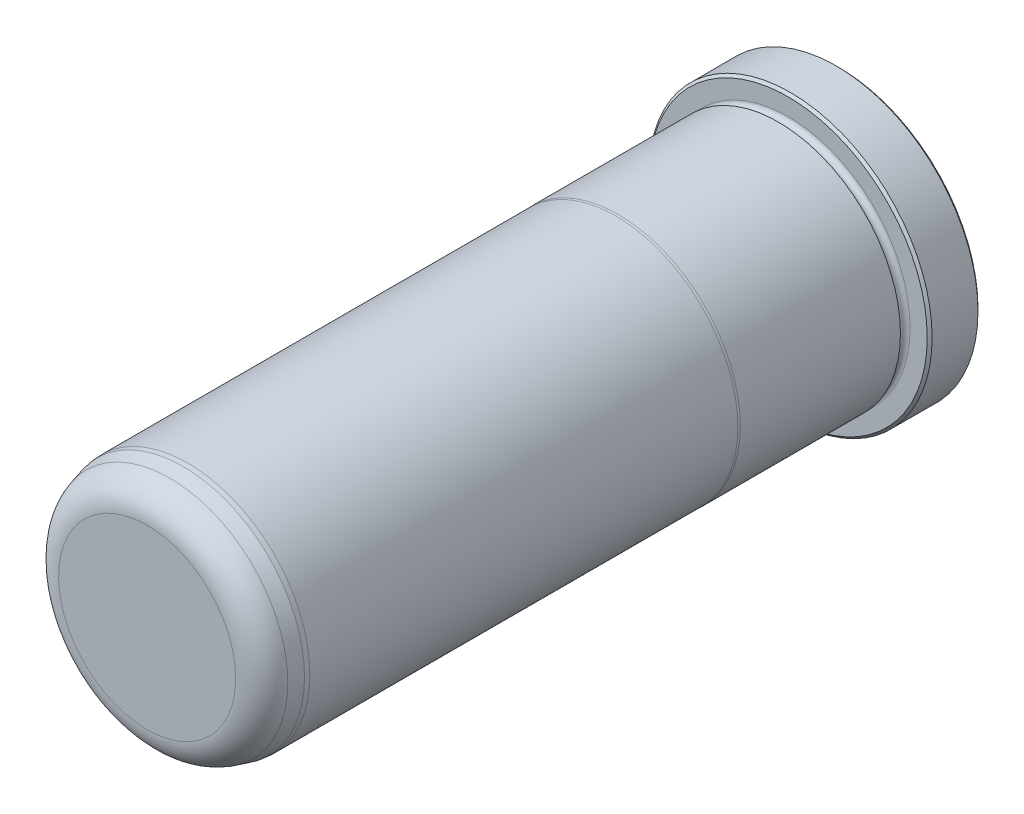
ISO-10303-21;
HEADER;
FILE_DESCRIPTION(('STEP AP214'),'2;1');
FILE_NAME('part.step','',(''),(''),'','','');
FILE_SCHEMA(('AUTOMOTIVE_DESIGN { 1 0 10303 214 1 1 1 1 }'));
ENDSEC;
DATA;
#1=APPLICATION_CONTEXT('core data for automotive mechanical design processes');
#2=APPLICATION_PROTOCOL_DEFINITION('international standard','automotive_design',2000,#1);
#3=PRODUCT_CONTEXT('',#1,'mechanical');
#4=PRODUCT('Part','Part','',(#3));
#5=PRODUCT_RELATED_PRODUCT_CATEGORY('part','',(#4));
#6=PRODUCT_DEFINITION_FORMATION('','',#4);
#7=PRODUCT_DEFINITION_CONTEXT('part definition',#1,'design');
#8=PRODUCT_DEFINITION('design','',#6,#7);
#9=PRODUCT_DEFINITION_SHAPE('','',#8);
#10=(LENGTH_UNIT() NAMED_UNIT(*) SI_UNIT(.MILLI.,.METRE.));
#11=(NAMED_UNIT(*) PLANE_ANGLE_UNIT() SI_UNIT($,.RADIAN.));
#12=(NAMED_UNIT(*) SI_UNIT($,.STERADIAN.) SOLID_ANGLE_UNIT());
#13=UNCERTAINTY_MEASURE_WITH_UNIT(LENGTH_MEASURE(1.E-05),#10,'distance_accuracy_value','');
#14=(GEOMETRIC_REPRESENTATION_CONTEXT(3) GLOBAL_UNCERTAINTY_ASSIGNED_CONTEXT((#13)) GLOBAL_UNIT_ASSIGNED_CONTEXT((#10,
#11,#12)) REPRESENTATION_CONTEXT('',''));
#15=CARTESIAN_POINT('',(0.,0.,0.));
#16=DIRECTION('',(0.,0.,1.));
#17=DIRECTION('',(1.,0.,0.));
#18=AXIS2_PLACEMENT_3D('',#15,#16,#17);
#19=CARTESIAN_POINT('',(0.,0.,0.));
#20=DIRECTION('',(0.,0.,1.));
#21=DIRECTION('',(1.,0.,0.));
#22=AXIS2_PLACEMENT_3D('',#19,#20,#21);
#23=PLANE('',#22);
#24=CARTESIAN_POINT('',(0.,0.,0.));
#25=DIRECTION('',(0.,0.,1.));
#26=DIRECTION('',(1.,0.,0.));
#27=AXIS2_PLACEMENT_3D('',#24,#25,#26);
#28=CIRCLE('',#27,21.717);
#29=CARTESIAN_POINT('',(21.717,0.,0.));
#30=VERTEX_POINT('',#29);
#31=EDGE_CURVE('E37',#30,#30,#28,.F.);
#32=ORIENTED_EDGE('',*,*,#31,.T.);
#33=EDGE_LOOP('',(#32));
#34=FACE_BOUND('',#33,.T.);
#35=ADVANCED_FACE('F30',(#34),#23,.F.);
#36=CARTESIAN_POINT('',(0.,0.,0.));
#37=DIRECTION('',(0.,0.,1.));
#38=DIRECTION('',(1.,0.,0.));
#39=AXIS2_PLACEMENT_3D('',#36,#37,#38);
#40=CYLINDRICAL_SURFACE('',#39,22.098);
#41=CARTESIAN_POINT('',(0.,0.,0.381000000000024));
#42=DIRECTION('',(0.,0.,1.));
#43=DIRECTION('',(1.,0.,0.));
#44=AXIS2_PLACEMENT_3D('',#41,#42,#43);
#45=CIRCLE('',#44,22.098);
#46=CARTESIAN_POINT('',(22.098,0.,0.381000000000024));
#47=VERTEX_POINT('',#46);
#48=EDGE_CURVE('E41',#47,#47,#45,.T.);
#49=ORIENTED_EDGE('',*,*,#48,.T.);
#50=EDGE_LOOP('',(#49));
#51=FACE_BOUND('',#50,.T.);
#52=CARTESIAN_POINT('',(0.,0.,7.5438));
#53=DIRECTION('',(0.,0.,-1.));
#54=DIRECTION('',(-1.,0.,0.));
#55=AXIS2_PLACEMENT_3D('',#52,#53,#54);
#56=CIRCLE('',#55,22.098);
#57=CARTESIAN_POINT('',(-22.098,0.,7.5438));
#58=VERTEX_POINT('',#57);
#59=EDGE_CURVE('E45',#58,#58,#56,.T.);
#60=ORIENTED_EDGE('',*,*,#59,.T.);
#61=EDGE_LOOP('',(#60));
#62=FACE_BOUND('',#61,.T.);
#63=ADVANCED_FACE('F118',(#51,#62),#40,.T.);
#64=CARTESIAN_POINT('',(0.,22.098,7.9248));
#65=DIRECTION('',(0.,0.,-1.));
#66=DIRECTION('',(-1.,0.,0.));
#67=AXIS2_PLACEMENT_3D('',#64,#65,#66);
#68=PLANE('',#67);
#69=CARTESIAN_POINT('',(0.,0.,7.9248));
#70=DIRECTION('',(0.,0.,-1.));
#71=DIRECTION('',(-1.,0.,0.));
#72=AXIS2_PLACEMENT_3D('',#69,#70,#71);
#73=CIRCLE('',#72,21.717);
#74=CARTESIAN_POINT('',(-21.717,0.,7.9248));
#75=VERTEX_POINT('',#74);
#76=EDGE_CURVE('E10',#75,#75,#73,.F.);
#77=ORIENTED_EDGE('',*,*,#76,.T.);
#78=EDGE_LOOP('',(#77));
#79=FACE_BOUND('',#78,.T.);
#80=CARTESIAN_POINT('',(0.,0.,7.9248));
#81=DIRECTION('',(0.,0.,1.));
#82=DIRECTION('',(1.,0.,0.));
#83=AXIS2_PLACEMENT_3D('',#80,#81,#82);
#84=CIRCLE('',#83,19.0373);
#85=CARTESIAN_POINT('',(19.0373,0.,7.9248));
#86=VERTEX_POINT('',#85);
#87=EDGE_CURVE('E56',#86,#86,#84,.T.);
#88=ORIENTED_EDGE('',*,*,#87,.F.);
#89=EDGE_LOOP('',(#88));
#90=FACE_BOUND('',#89,.T.);
#91=ADVANCED_FACE('F113',(#79,#90),#68,.F.);
#92=CARTESIAN_POINT('',(0.,0.,8.6868));
#93=DIRECTION('',(0.,0.,1.));
#94=DIRECTION('',(1.,0.,0.));
#95=AXIS2_PLACEMENT_3D('',#92,#93,#94);
#96=TOROIDAL_SURFACE('',#95,19.0373,0.762);
#97=CARTESIAN_POINT('',(0.,0.,9.4488));
#98=DIRECTION('',(0.,0.,1.));
#99=DIRECTION('',(1.,0.,0.));
#100=AXIS2_PLACEMENT_3D('',#97,#98,#99);
#101=CIRCLE('',#100,19.0373);
#102=CARTESIAN_POINT('',(19.0373,0.,9.4488));
#103=VERTEX_POINT('',#102);
#104=EDGE_CURVE('E59',#103,#103,#101,.T.);
#105=ORIENTED_EDGE('',*,*,#104,.F.);
#106=EDGE_LOOP('',(#105));
#107=FACE_BOUND('',#106,.T.);
#108=ORIENTED_EDGE('',*,*,#87,.T.);
#109=EDGE_LOOP('',(#108));
#110=FACE_BOUND('',#109,.T.);
#111=ADVANCED_FACE('F107',(#107,#110),#96,.F.);
#112=CARTESIAN_POINT('',(0.,19.0373,9.4488));
#113=DIRECTION('',(0.,0.,1.));
#114=DIRECTION('',(1.,0.,0.));
#115=AXIS2_PLACEMENT_3D('',#112,#113,#114);
#116=PLANE('',#115);
#117=CARTESIAN_POINT('',(0.,0.,9.4488));
#118=DIRECTION('',(0.,0.,1.));
#119=DIRECTION('',(1.,0.,0.));
#120=AXIS2_PLACEMENT_3D('',#117,#118,#119);
#121=CIRCLE('',#120,19.0627);
#122=CARTESIAN_POINT('',(19.0627,0.,9.4488));
#123=VERTEX_POINT('',#122);
#124=EDGE_CURVE('E62',#123,#123,#121,.T.);
#125=ORIENTED_EDGE('',*,*,#124,.F.);
#126=EDGE_LOOP('',(#125));
#127=FACE_BOUND('',#126,.T.);
#128=ORIENTED_EDGE('',*,*,#104,.T.);
#129=EDGE_LOOP('',(#128));
#130=FACE_BOUND('',#129,.T.);
#131=ADVANCED_FACE('F101',(#127,#130),#116,.F.);
#132=CARTESIAN_POINT('',(0.,0.,0.));
#133=DIRECTION('',(0.,0.,1.));
#134=DIRECTION('',(1.,0.,0.));
#135=AXIS2_PLACEMENT_3D('',#132,#133,#134);
#136=CYLINDRICAL_SURFACE('',#135,19.0627);
#137=CARTESIAN_POINT('',(0.,0.,34.4347630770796));
#138=DIRECTION('',(0.,0.,1.));
#139=DIRECTION('',(1.,0.,0.));
#140=AXIS2_PLACEMENT_3D('',#137,#138,#139);
#141=CIRCLE('',#140,19.0627);
#142=CARTESIAN_POINT('',(19.0627,0.,34.4347630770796));
#143=VERTEX_POINT('',#142);
#144=EDGE_CURVE('E65',#143,#143,#141,.T.);
#145=ORIENTED_EDGE('',*,*,#144,.F.);
#146=EDGE_LOOP('',(#145));
#147=FACE_BOUND('',#146,.T.);
#148=ORIENTED_EDGE('',*,*,#124,.T.);
#149=EDGE_LOOP('',(#148));
#150=FACE_BOUND('',#149,.T.);
#151=ADVANCED_FACE('F95',(#147,#150),#136,.T.);
#152=CARTESIAN_POINT('',(0.,0.,34.4347630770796));
#153=DIRECTION('',(0.,0.,-1.));
#154=DIRECTION('',(-1.,0.,0.));
#155=AXIS2_PLACEMENT_3D('',#152,#153,#154);
#156=CONICAL_SURFACE('',#155,19.0627,0.0698131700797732);
#157=CARTESIAN_POINT('',(0.,0.,34.798));
#158=DIRECTION('',(0.,0.,1.));
#159=DIRECTION('',(1.,0.,0.));
#160=AXIS2_PLACEMENT_3D('',#157,#158,#159);
#161=CIRCLE('',#160,19.0373);
#162=CARTESIAN_POINT('',(19.0373,0.,34.798));
#163=VERTEX_POINT('',#162);
#164=EDGE_CURVE('E68',#163,#163,#161,.T.);
#165=ORIENTED_EDGE('',*,*,#164,.F.);
#166=EDGE_LOOP('',(#165));
#167=FACE_BOUND('',#166,.T.);
#168=ORIENTED_EDGE('',*,*,#144,.T.);
#169=EDGE_LOOP('',(#168));
#170=FACE_BOUND('',#169,.T.);
#171=ADVANCED_FACE('F89',(#167,#170),#156,.T.);
#172=CARTESIAN_POINT('',(0.,0.,0.));
#173=DIRECTION('',(0.,0.,1.));
#174=DIRECTION('',(1.,0.,0.));
#175=AXIS2_PLACEMENT_3D('',#172,#173,#174);
#176=CYLINDRICAL_SURFACE('',#175,19.0373);
#177=CARTESIAN_POINT('',(0.,0.,101.6));
#178=DIRECTION('',(0.,0.,1.));
#179=DIRECTION('',(1.,0.,0.));
#180=AXIS2_PLACEMENT_3D('',#177,#178,#179);
#181=CIRCLE('',#180,19.0373);
#182=CARTESIAN_POINT('',(19.0373,0.,101.6));
#183=VERTEX_POINT('',#182);
#184=EDGE_CURVE('E71',#183,#183,#181,.T.);
#185=ORIENTED_EDGE('',*,*,#184,.F.);
#186=EDGE_LOOP('',(#185));
#187=FACE_BOUND('',#186,.T.);
#188=ORIENTED_EDGE('',*,*,#164,.T.);
#189=EDGE_LOOP('',(#188));
#190=FACE_BOUND('',#189,.T.);
#191=ADVANCED_FACE('F83',(#187,#190),#176,.T.);
#192=CARTESIAN_POINT('',(0.,0.,101.6));
#193=DIRECTION('',(0.,0.,-1.));
#194=DIRECTION('',(-1.,0.,0.));
#195=AXIS2_PLACEMENT_3D('',#192,#193,#194);
#196=CONICAL_SURFACE('',#195,19.0373,0.0872664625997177);
#197=CARTESIAN_POINT('',(0.,0.,102.362));
#198=DIRECTION('',(0.,0.,1.));
#199=DIRECTION('',(1.,0.,0.));
#200=AXIS2_PLACEMENT_3D('',#197,#198,#199);
#201=CIRCLE('',#200,18.9706336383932);
#202=CARTESIAN_POINT('',(18.9706336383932,0.,102.362));
#203=VERTEX_POINT('',#202);
#204=EDGE_CURVE('E74',#203,#203,#201,.T.);
#205=ORIENTED_EDGE('',*,*,#204,.F.);
#206=EDGE_LOOP('',(#205));
#207=FACE_BOUND('',#206,.T.);
#208=ORIENTED_EDGE('',*,*,#184,.T.);
#209=EDGE_LOOP('',(#208));
#210=FACE_BOUND('',#209,.T.);
#211=ADVANCED_FACE('F80',(#207,#210),#196,.T.);
#212=CARTESIAN_POINT('',(0.,0.,102.362));
#213=DIRECTION('',(0.,0.,-1.));
#214=DIRECTION('',(-1.,0.,0.));
#215=AXIS2_PLACEMENT_3D('',#212,#213,#214);
#216=CONICAL_SURFACE('',#215,18.9706336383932,0.261799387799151);
#217=CARTESIAN_POINT('',(0.,0.,104.420125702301));
#218=DIRECTION('',(0.,0.,1.));
#219=DIRECTION('',(1.,0.,0.));
#220=AXIS2_PLACEMENT_3D('',#217,#218,#219);
#221=CIRCLE('',#220,18.41916051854);
#222=CARTESIAN_POINT('',(18.41916051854,0.,104.420125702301));
#223=VERTEX_POINT('',#222);
#224=EDGE_CURVE('E50',#223,#223,#221,.F.);
#225=ORIENTED_EDGE('',*,*,#224,.T.);
#226=EDGE_LOOP('',(#225));
#227=FACE_BOUND('',#226,.T.);
#228=ORIENTED_EDGE('',*,*,#204,.T.);
#229=EDGE_LOOP('',(#228));
#230=FACE_BOUND('',#229,.T.);
#231=ADVANCED_FACE('F78',(#227,#230),#216,.T.);
#232=CARTESIAN_POINT('',(0.,17.4733335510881,107.95));
#233=DIRECTION('',(0.,0.,-1.));
#234=DIRECTION('',(-1.,0.,0.));
#235=AXIS2_PLACEMENT_3D('',#232,#233,#234);
#236=PLANE('',#235);
#237=CARTESIAN_POINT('',(0.,0.,107.95));
#238=DIRECTION('',(0.,0.,-1.));
#239=DIRECTION('',(-1.,0.,0.));
#240=AXIS2_PLACEMENT_3D('',#237,#238,#239);
#241=CIRCLE('',#240,13.8189387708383);
#242=CARTESIAN_POINT('',(-13.8189387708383,0.,107.95));
#243=VERTEX_POINT('',#242);
#244=EDGE_CURVE('E53',#243,#243,#241,.F.);
#245=ORIENTED_EDGE('',*,*,#244,.T.);
#246=EDGE_LOOP('',(#245));
#247=FACE_BOUND('',#246,.T.);
#248=ADVANCED_FACE('F133',(#247),#236,.F.);
#249=CARTESIAN_POINT('',(0.,0.,103.1875));
#250=DIRECTION('',(0.,0.,-1.));
#251=DIRECTION('',(-1.,0.,0.));
#252=AXIS2_PLACEMENT_3D('',#249,#250,#251);
#253=TOROIDAL_SURFACE('',#252,13.8189387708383,4.7625);
#254=ORIENTED_EDGE('',*,*,#224,.F.);
#255=EDGE_LOOP('',(#254));
#256=FACE_BOUND('',#255,.T.);
#257=ORIENTED_EDGE('',*,*,#244,.F.);
#258=EDGE_LOOP('',(#257));
#259=FACE_BOUND('',#258,.T.);
#260=ADVANCED_FACE('F130',(#256,#259),#253,.T.);
#261=CARTESIAN_POINT('',(0.,0.,0.381000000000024));
#262=DIRECTION('',(0.,0.,1.));
#263=DIRECTION('',(1.,0.,0.));
#264=AXIS2_PLACEMENT_3D('',#261,#262,#263);
#265=CONICAL_SURFACE('',#264,22.098,0.785398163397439);
#266=ORIENTED_EDGE('',*,*,#31,.F.);
#267=EDGE_LOOP('',(#266));
#268=FACE_BOUND('',#267,.T.);
#269=ORIENTED_EDGE('',*,*,#48,.F.);
#270=EDGE_LOOP('',(#269));
#271=FACE_BOUND('',#270,.T.);
#272=ADVANCED_FACE('F132',(#268,#271),#265,.T.);
#273=CARTESIAN_POINT('',(0.,0.,7.9248));
#274=DIRECTION('',(0.,0.,-1.));
#275=DIRECTION('',(-1.,0.,0.));
#276=AXIS2_PLACEMENT_3D('',#273,#274,#275);
#277=CONICAL_SURFACE('',#276,21.717,0.785398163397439);
#278=ORIENTED_EDGE('',*,*,#59,.F.);
#279=EDGE_LOOP('',(#278));
#280=FACE_BOUND('',#279,.T.);
#281=ORIENTED_EDGE('',*,*,#76,.F.);
#282=EDGE_LOOP('',(#281));
#283=FACE_BOUND('',#282,.T.);
#284=ADVANCED_FACE('F32',(#280,#283),#277,.T.);
#285=CLOSED_SHELL('',(#35,#63,#91,#111,#131,#151,#171,#191,#211,#231,#248,#260,#272,#284));
#286=MANIFOLD_SOLID_BREP('B2',#285);
#287=ADVANCED_BREP_SHAPE_REPRESENTATION('',(#18,#286),#14);
#288=SHAPE_DEFINITION_REPRESENTATION(#9,#287);
ENDSEC;
END-ISO-10303-21;
